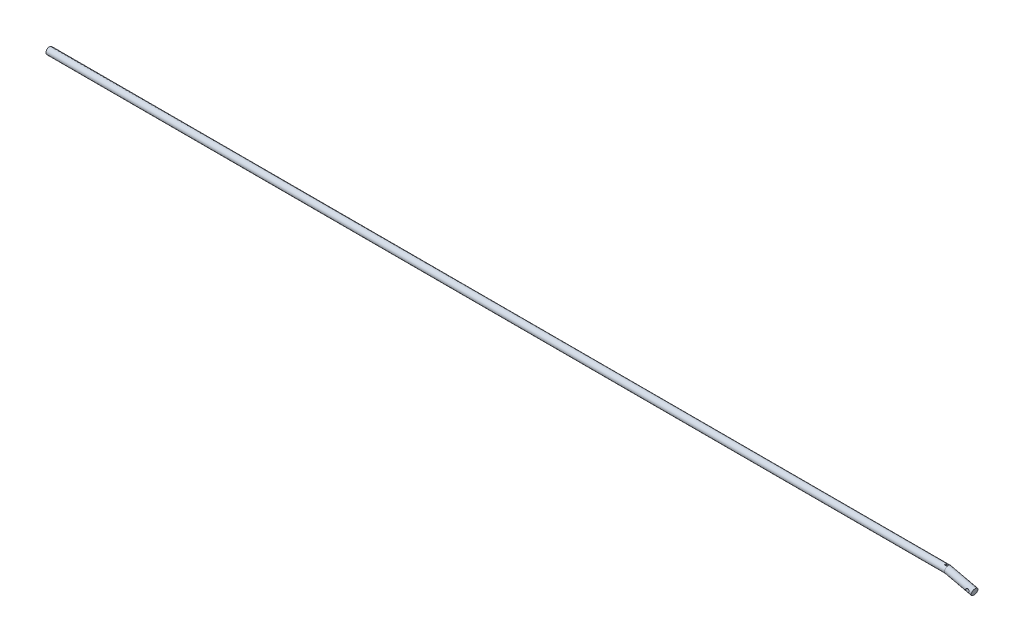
from build123d import *

# Parameters (mm, degrees)
SKETCH2_R           = 4
EXTRUDE1_DEPTH      = 1099.064184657
EXTRUDE1_DEPTH_BACK = 1099.064184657
SKETCH3_R           = 1.9
EXTRUDE3_DEPTH      = 10
EXTRUDE3_DEPTH_BACK = 1
SKETCH4_W           = 2.345806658
SKETCH4_H           = 2.557728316


with BuildPart() as part:
    # Sweep1: sweep along a path in Sketch1
    with BuildLine(Plane.XY) as sweep1_path:
        Line((0, 0), (1065.480226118, 0))
        Line((1065.480226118, 0), (1097.1, -7.3))
    # Sketch2 → Sweep1 (sweep)
    with BuildSketch(Plane(origin=(0, 0, 0), x_dir=(0, 0, -1), z_dir=(1, 0, 0))):
        Circle(SKETCH2_R)
    sweep(path=sweep1_path.line, transition=Transition.RIGHT)

    # Sketch3 → Extrude1 (cut, two sides: drawn at the far end of the back side and taken through both)
    with BuildSketch(Plane.XY.offset(-EXTRUDE1_DEPTH_BACK)):
        with Locations((1092.520460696, -6.242730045)):
            Circle(SKETCH3_R)
    extrude(amount=EXTRUDE1_DEPTH + EXTRUDE1_DEPTH_BACK, mode=Mode.SUBTRACT)

    # Sketch4 → Extrude3 (cut, two sides: drawn at the far end of the back side and taken through both)
    with BuildSketch(Plane(origin=(0, 3.5, 0), x_dir=(-1, 0, 0), z_dir=(0, 1, 0)).offset(-EXTRUDE3_DEPTH_BACK)):
        with Locations((-1063.851580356, 0)):
            Rectangle(SKETCH4_W, SKETCH4_H)
    extrude(amount=EXTRUDE3_DEPTH + EXTRUDE3_DEPTH_BACK, mode=Mode.SUBTRACT)


solid = part.part
